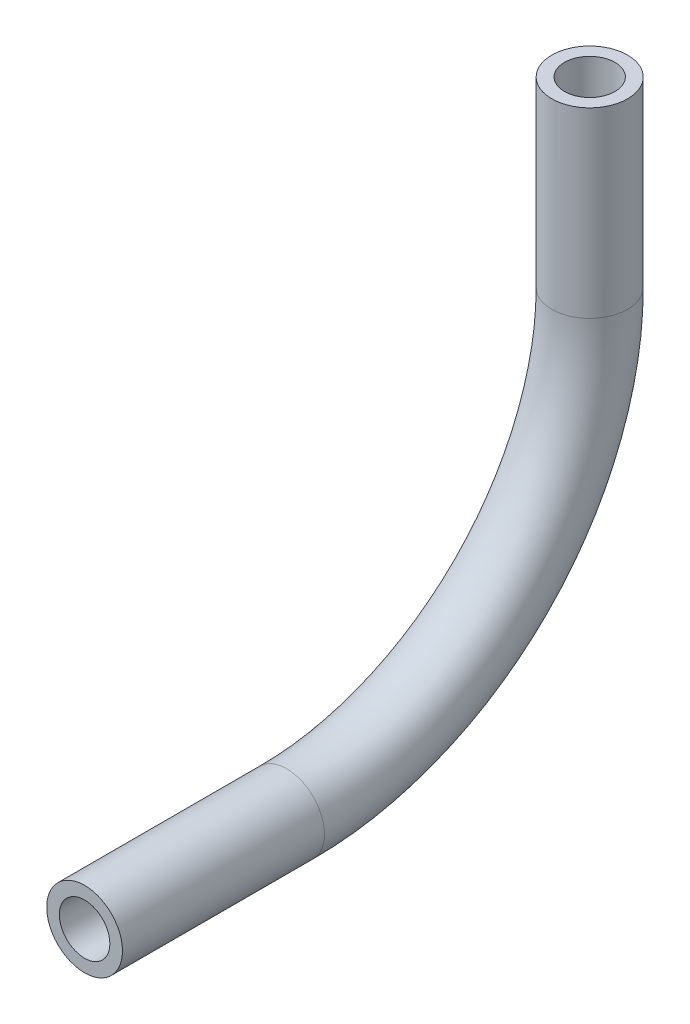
ISO-10303-21;
HEADER;
FILE_DESCRIPTION(('STEP AP214'),'2;1');
FILE_NAME('part.step','',(''),(''),'','','');
FILE_SCHEMA(('AUTOMOTIVE_DESIGN { 1 0 10303 214 1 1 1 1 }'));
ENDSEC;
DATA;
#1=APPLICATION_CONTEXT('core data for automotive mechanical design processes');
#2=APPLICATION_PROTOCOL_DEFINITION('international standard','automotive_design',2000,#1);
#3=PRODUCT_CONTEXT('',#1,'mechanical');
#4=PRODUCT('Part','Part','',(#3));
#5=PRODUCT_RELATED_PRODUCT_CATEGORY('part','',(#4));
#6=PRODUCT_DEFINITION_FORMATION('','',#4);
#7=PRODUCT_DEFINITION_CONTEXT('part definition',#1,'design');
#8=PRODUCT_DEFINITION('design','',#6,#7);
#9=PRODUCT_DEFINITION_SHAPE('','',#8);
#10=(LENGTH_UNIT() NAMED_UNIT(*) SI_UNIT(.MILLI.,.METRE.));
#11=(NAMED_UNIT(*) PLANE_ANGLE_UNIT() SI_UNIT($,.RADIAN.));
#12=(NAMED_UNIT(*) SI_UNIT($,.STERADIAN.) SOLID_ANGLE_UNIT());
#13=UNCERTAINTY_MEASURE_WITH_UNIT(LENGTH_MEASURE(1.E-05),#10,'distance_accuracy_value','');
#14=(GEOMETRIC_REPRESENTATION_CONTEXT(3) GLOBAL_UNCERTAINTY_ASSIGNED_CONTEXT((#13)) GLOBAL_UNIT_ASSIGNED_CONTEXT((#10,
#11,#12)) REPRESENTATION_CONTEXT('',''));
#15=CARTESIAN_POINT('',(0.,0.,0.));
#16=DIRECTION('',(0.,0.,1.));
#17=DIRECTION('',(1.,0.,0.));
#18=AXIS2_PLACEMENT_3D('',#15,#16,#17);
#19=CARTESIAN_POINT('',(0.,76.2,-127.));
#20=DIRECTION('',(0.,1.,0.));
#21=DIRECTION('',(0.,0.,1.));
#22=AXIS2_PLACEMENT_3D('',#19,#20,#21);
#23=CYLINDRICAL_SURFACE('',#22,9.525);
#24=CARTESIAN_POINT('',(0.,76.2,-127.));
#25=DIRECTION('',(0.,-1.,0.));
#26=DIRECTION('',(1.,0.,0.));
#27=AXIS2_PLACEMENT_3D('',#24,#25,#26);
#28=CIRCLE('',#27,9.525);
#29=CARTESIAN_POINT('',(0.,76.2,-136.525));
#30=VERTEX_POINT('',#29);
#31=EDGE_CURVE('E41',#30,#30,#28,.T.);
#32=ORIENTED_EDGE('',*,*,#31,.F.);
#33=EDGE_LOOP('',(#32));
#34=FACE_BOUND('',#33,.T.);
#35=CARTESIAN_POINT('',(0.,122.050616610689,-127.));
#36=DIRECTION('',(0.,-1.,0.));
#37=DIRECTION('',(1.,0.,0.));
#38=AXIS2_PLACEMENT_3D('',#35,#36,#37);
#39=CIRCLE('',#38,9.525);
#40=CARTESIAN_POINT('',(9.525,122.050616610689,-127.));
#41=VERTEX_POINT('',#40);
#42=EDGE_CURVE('E10',#41,#41,#39,.T.);
#43=ORIENTED_EDGE('',*,*,#42,.T.);
#44=EDGE_LOOP('',(#43));
#45=FACE_BOUND('',#44,.T.);
#46=ADVANCED_FACE('F31',(#34,#45),#23,.T.);
#47=CARTESIAN_POINT('',(0.,76.2,-127.));
#48=DIRECTION('',(0.,1.,0.));
#49=DIRECTION('',(0.,0.,1.));
#50=AXIS2_PLACEMENT_3D('',#47,#48,#49);
#51=CYLINDRICAL_SURFACE('',#50,6.35);
#52=CARTESIAN_POINT('',(0.,76.2,-127.));
#53=DIRECTION('',(0.,-1.,0.));
#54=DIRECTION('',(1.,0.,0.));
#55=AXIS2_PLACEMENT_3D('',#52,#53,#54);
#56=CIRCLE('',#55,6.35);
#57=CARTESIAN_POINT('',(0.,76.2,-133.35));
#58=VERTEX_POINT('',#57);
#59=EDGE_CURVE('E45',#58,#58,#56,.T.);
#60=ORIENTED_EDGE('',*,*,#59,.T.);
#61=EDGE_LOOP('',(#60));
#62=FACE_BOUND('',#61,.T.);
#63=CARTESIAN_POINT('',(0.,122.050616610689,-127.));
#64=DIRECTION('',(0.,-1.,0.));
#65=DIRECTION('',(1.,0.,0.));
#66=AXIS2_PLACEMENT_3D('',#63,#64,#65);
#67=CIRCLE('',#66,6.35);
#68=CARTESIAN_POINT('',(6.35,122.050616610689,-127.));
#69=VERTEX_POINT('',#68);
#70=EDGE_CURVE('E37',#69,#69,#67,.T.);
#71=ORIENTED_EDGE('',*,*,#70,.F.);
#72=EDGE_LOOP('',(#71));
#73=FACE_BOUND('',#72,.T.);
#74=ADVANCED_FACE('F88',(#62,#73),#51,.F.);
#75=CARTESIAN_POINT('',(0.,76.2,-50.8));
#76=DIRECTION('',(1.,0.,0.));
#77=DIRECTION('',(0.,0.,-1.));
#78=AXIS2_PLACEMENT_3D('',#75,#76,#77);
#79=TOROIDAL_SURFACE('',#78,76.2,9.525);
#80=CARTESIAN_POINT('',(0.,0.,-50.8));
#81=DIRECTION('',(0.,0.,1.));
#82=DIRECTION('',(1.,0.,0.));
#83=AXIS2_PLACEMENT_3D('',#80,#81,#82);
#84=CIRCLE('',#83,9.525);
#85=CARTESIAN_POINT('',(0.,-9.52499999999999,-50.8));
#86=VERTEX_POINT('',#85);
#87=EDGE_CURVE('E50',#86,#86,#84,.T.);
#88=CARTESIAN_POINT('',(0.,76.2,-50.8));
#89=DIRECTION('',(1.,0.,0.));
#90=DIRECTION('',(0.,0.,-1.));
#91=AXIS2_PLACEMENT_3D('',#88,#89,#90);
#92=CIRCLE('',#91,85.725);
#93=EDGE_CURVE('',#86,#30,#92,.T.);
#94=ORIENTED_EDGE('',*,*,#87,.F.);
#95=ORIENTED_EDGE('',*,*,#31,.T.);
#96=ORIENTED_EDGE('',*,*,#93,.T.);
#97=ORIENTED_EDGE('',*,*,#93,.F.);
#98=EDGE_LOOP('',(#94,#96,#95,#97));
#99=FACE_BOUND('',#98,.T.);
#100=ADVANCED_FACE('F93',(#99),#79,.T.);
#101=CARTESIAN_POINT('',(0.,76.2,-50.8));
#102=DIRECTION('',(1.,0.,0.));
#103=DIRECTION('',(0.,0.,-1.));
#104=AXIS2_PLACEMENT_3D('',#101,#102,#103);
#105=TOROIDAL_SURFACE('',#104,76.2,6.35);
#106=CARTESIAN_POINT('',(0.,0.,-50.8));
#107=DIRECTION('',(0.,0.,1.));
#108=DIRECTION('',(1.,0.,0.));
#109=AXIS2_PLACEMENT_3D('',#106,#107,#108);
#110=CIRCLE('',#109,6.35);
#111=CARTESIAN_POINT('',(0.,-6.34999999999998,-50.8));
#112=VERTEX_POINT('',#111);
#113=EDGE_CURVE('E54',#112,#112,#110,.T.);
#114=CARTESIAN_POINT('',(0.,76.2,-50.8));
#115=DIRECTION('',(1.,0.,0.));
#116=DIRECTION('',(0.,0.,-1.));
#117=AXIS2_PLACEMENT_3D('',#114,#115,#116);
#118=CIRCLE('',#117,82.55);
#119=EDGE_CURVE('',#112,#58,#118,.T.);
#120=ORIENTED_EDGE('',*,*,#113,.T.);
#121=ORIENTED_EDGE('',*,*,#59,.F.);
#122=ORIENTED_EDGE('',*,*,#119,.T.);
#123=ORIENTED_EDGE('',*,*,#119,.F.);
#124=EDGE_LOOP('',(#120,#122,#121,#123));
#125=FACE_BOUND('',#124,.T.);
#126=ADVANCED_FACE('F63',(#125),#105,.F.);
#127=CARTESIAN_POINT('',(0.,0.,-50.8));
#128=DIRECTION('',(0.,0.,1.));
#129=DIRECTION('',(1.,0.,0.));
#130=AXIS2_PLACEMENT_3D('',#127,#128,#129);
#131=CYLINDRICAL_SURFACE('',#130,6.35);
#132=ORIENTED_EDGE('',*,*,#113,.F.);
#133=EDGE_LOOP('',(#132));
#134=FACE_BOUND('',#133,.T.);
#135=CARTESIAN_POINT('',(0.,0.,0.));
#136=DIRECTION('',(0.,0.,1.));
#137=DIRECTION('',(1.,0.,0.));
#138=AXIS2_PLACEMENT_3D('',#135,#136,#137);
#139=CIRCLE('',#138,6.35);
#140=CARTESIAN_POINT('',(6.35,0.,0.));
#141=VERTEX_POINT('',#140);
#142=EDGE_CURVE('E55',#141,#141,#139,.T.);
#143=ORIENTED_EDGE('',*,*,#142,.T.);
#144=EDGE_LOOP('',(#143));
#145=FACE_BOUND('',#144,.T.);
#146=ADVANCED_FACE('F66',(#134,#145),#131,.F.);
#147=CARTESIAN_POINT('',(0.,0.,-50.8));
#148=DIRECTION('',(0.,0.,1.));
#149=DIRECTION('',(1.,0.,0.));
#150=AXIS2_PLACEMENT_3D('',#147,#148,#149);
#151=CYLINDRICAL_SURFACE('',#150,9.525);
#152=ORIENTED_EDGE('',*,*,#87,.T.);
#153=EDGE_LOOP('',(#152));
#154=FACE_BOUND('',#153,.T.);
#155=CARTESIAN_POINT('',(0.,0.,0.));
#156=DIRECTION('',(0.,0.,1.));
#157=DIRECTION('',(1.,0.,0.));
#158=AXIS2_PLACEMENT_3D('',#155,#156,#157);
#159=CIRCLE('',#158,9.525);
#160=CARTESIAN_POINT('',(9.525,0.,0.));
#161=VERTEX_POINT('',#160);
#162=EDGE_CURVE('E51',#161,#161,#159,.T.);
#163=ORIENTED_EDGE('',*,*,#162,.F.);
#164=EDGE_LOOP('',(#163));
#165=FACE_BOUND('',#164,.T.);
#166=ADVANCED_FACE('F69',(#154,#165),#151,.T.);
#167=CARTESIAN_POINT('',(0.,122.050616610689,-127.));
#168=DIRECTION('',(0.,-1.,0.));
#169=DIRECTION('',(1.,0.,0.));
#170=AXIS2_PLACEMENT_3D('',#167,#168,#169);
#171=PLANE('',#170);
#172=ORIENTED_EDGE('',*,*,#70,.T.);
#173=EDGE_LOOP('',(#172));
#174=FACE_BOUND('',#173,.T.);
#175=ORIENTED_EDGE('',*,*,#42,.F.);
#176=EDGE_LOOP('',(#175));
#177=FACE_BOUND('',#176,.T.);
#178=ADVANCED_FACE('F76',(#174,#177),#171,.F.);
#179=CARTESIAN_POINT('',(0.,0.,0.));
#180=DIRECTION('',(0.,0.,1.));
#181=DIRECTION('',(1.,0.,0.));
#182=AXIS2_PLACEMENT_3D('',#179,#180,#181);
#183=PLANE('',#182);
#184=ORIENTED_EDGE('',*,*,#142,.F.);
#185=EDGE_LOOP('',(#184));
#186=FACE_BOUND('',#185,.T.);
#187=ORIENTED_EDGE('',*,*,#162,.T.);
#188=EDGE_LOOP('',(#187));
#189=FACE_BOUND('',#188,.T.);
#190=ADVANCED_FACE('F73',(#186,#189),#183,.T.);
#191=CLOSED_SHELL('',(#46,#74,#100,#126,#146,#166,#178,#190));
#192=MANIFOLD_SOLID_BREP('B2',#191);
#193=ADVANCED_BREP_SHAPE_REPRESENTATION('',(#18,#192),#14);
#194=SHAPE_DEFINITION_REPRESENTATION(#9,#193);
ENDSEC;
END-ISO-10303-21;
